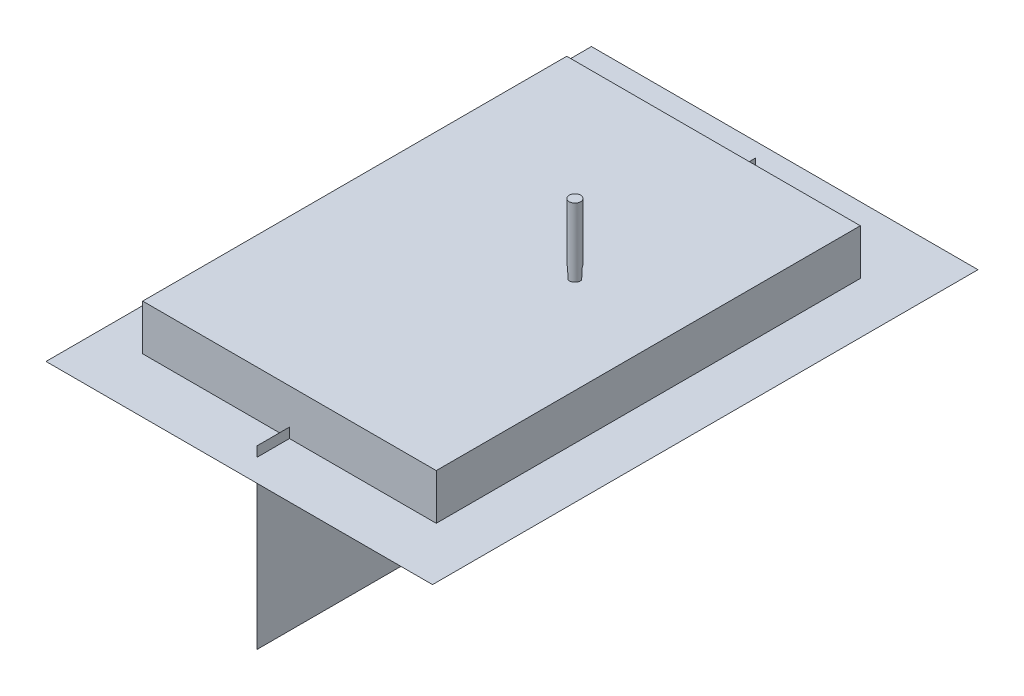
from build123d import *

# Parameters (mm, degrees)
BOSS_EXTRUDE1_DEPTH          = 2
BOSS_EXTRUDE2_DEPTH          = 2
BOSS_EXTRUDE3_DEPTH          = 2
BOSS_EXTRUDE4_DEPTH          = 2
SKETCH6_RX                   = 25
SKETCH6_RY                   = 7.5
BOSS_EXTRUDE5_DEPTH          = 2
BOSS_EXTRUDE6_DEPTH          = 2
BOSS_EXTRUDE7_DEPTH          = 2
BOSS_EXTRUDE8_DEPTH          = 2
BOSS_EXTRUDE9_DEPTH          = 2
SKETCH11_RX                  = 22.5
SKETCH11_RY                  = 12.5
BOSS_EXTRUDE10_DEPTH         = 2
BOSS_EXTRUDE11_DEPTH         = 2
BOSS_EXTRUDE12_DEPTH         = 1
BOSS_EXTRUDE13_START         = 2
SKETCH14_R                   = 3.5
BOSS_EXTRUDE13_DEPTH         = 50
CUT_EXTRUDE1_DEPTH           = 15
CUT_EXTRUDE1_DRAFT           = -5
CUT_EXTRUDE1_PROFILE_2_DEPTH = 15
CUT_EXTRUDE1_PROFILE_2_DRAFT = -5
SKETCH17_W                   = 180
SKETCH17_H                   = 260
BOSS_EXTRUDE14_DEPTH         = 28


with BuildPart() as part:
    # Sketch2 → Boss-Extrude1 (new body)
    with BuildSketch(Plane(origin=(0, 0, 0), x_dir=(1, 0, 0), z_dir=(0, 1, 0))):
        with BuildLine():
            ThreePointArc((84.993020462, 169.842764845), (0, 250), (-84.993020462, 169.842764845))
            ThreePointArc((-84.993020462, 169.842764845), (-83.737303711, 161.606035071), (-79.234438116, 154.595703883))
            ThreePointArc((-79.234438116, 154.595703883), (-53.016197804, 110.883102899), (-50, 60))
            ThreePointArc((-50, 60), (0, 0), (50, 60))
            ThreePointArc((50, 60), (53.016197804, 110.883102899), (79.234438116, 154.595703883))
            ThreePointArc((79.234438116, 154.595703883), (83.737303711, 161.606035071), (84.993020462, 169.842764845))
        make_face()
    extrude(amount=BOSS_EXTRUDE1_DEPTH)

    # Sketch3 → Boss-Extrude2 (add)
    with BuildSketch(Plane(origin=(0, 2, 0), x_dir=(1, 0, 0), z_dir=(0, 1, 0))):
        with BuildLine():
            ThreePointArc((77.81372295, 156.003385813), (81.866301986, 162.312683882), (82.996447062, 169.725740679))
            ThreePointArc((82.996447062, 169.725740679), (0, 248), (-82.996447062, 169.725740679))
            ThreePointArc((-82.996447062, 169.725740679), (-81.866301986, 162.312683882), (-77.81372295, 156.003385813))
            ThreePointArc((-77.81372295, 156.003385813), (-51.105368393, 111.473637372), (-48.032786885, 59.639344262))
            ThreePointArc((-48.032786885, 59.639344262), (0, 2), (48.032786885, 59.639344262))
            ThreePointArc((48.032786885, 59.639344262), (51.105368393, 111.473637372), (77.81372295, 156.003385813))
        make_face()
    extrude(amount=BOSS_EXTRUDE2_DEPTH)

    # Sketch4 → Boss-Extrude3 (add)
    with BuildSketch(Plane(origin=(0, 4, 0), x_dir=(1, 0, 0), z_dir=(0, 1, 0))):
        with BuildLine():
            ThreePointArc((76.393007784, 157.411067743), (49.194538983, 112.064171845), (46.06557377, 59.278688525))
            ThreePointArc((46.06557377, 59.278688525), (0, 4), (-46.06557377, 59.278688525))
            ThreePointArc((-46.06557377, 59.278688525), (-49.194538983, 112.064171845), (-76.393007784, 157.411067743))
            ThreePointArc((-76.393007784, 157.411067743), (-79.99530026, 163.019332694), (-80.999873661, 169.608716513))
            ThreePointArc((-80.999873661, 169.608716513), (0, 246), (80.999873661, 169.608716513))
            ThreePointArc((80.999873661, 169.608716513), (79.99530026, 163.019332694), (76.393007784, 157.411067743))
        make_face()
    extrude(amount=BOSS_EXTRUDE3_DEPTH)

    # Sketch5 → Boss-Extrude4 (add)
    with BuildSketch(Plane(origin=(0, 6, 0), x_dir=(1, 0, 0), z_dir=(0, 1, 0))):
        with BuildLine():
            ThreePointArc((74.972292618, 158.818749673), (78.124298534, 163.725981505), (79.00330026, 169.491692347))
            ThreePointArc((79.00330026, 169.491692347), (0, 244), (-79.00330026, 169.491692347))
            ThreePointArc((-79.00330026, 169.491692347), (-78.124298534, 163.725981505), (-74.972292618, 158.818749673))
            ThreePointArc((-74.972292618, 158.818749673), (-47.283709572, 112.654706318), (-44.098360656, 58.918032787))
            ThreePointArc((-44.098360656, 58.918032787), (0, 6), (44.098360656, 58.918032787))
            ThreePointArc((44.098360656, 58.918032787), (47.283709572, 112.654706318), (74.972292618, 158.818749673))
        make_face()
    extrude(amount=BOSS_EXTRUDE4_DEPTH)

    # Sketch6 → Boss-Extrude5 (add)
    with BuildSketch(Plane(origin=(0, 8, 0), x_dir=(1, 0, 0), z_dir=(0, 1, 0))):
        with BuildLine():
            ThreePointArc((73.551577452, 160.226431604), (45.372880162, 113.245240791), (42.131147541, 58.557377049))
            ThreePointArc((42.131147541, 58.557377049), (0, 8), (-42.131147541, 58.557377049))
            ThreePointArc((-42.131147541, 58.557377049), (-45.372880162, 113.245240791), (-73.551577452, 160.226431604))
            ThreePointArc((-73.551577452, 160.226431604), (-76.253296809, 164.432630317), (-77.006726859, 169.374668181))
            ThreePointArc((-77.006726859, 169.374668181), (0, 242), (77.006726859, 169.374668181))
            ThreePointArc((77.006726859, 169.374668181), (76.253296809, 164.432630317), (73.551577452, 160.226431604))
        make_face()
        with Locations(Location((0, 90), (0, 0, 90))):
            Ellipse(SKETCH6_RX, SKETCH6_RY, mode=Mode.SUBTRACT)
    extrude(amount=BOSS_EXTRUDE5_DEPTH)

    # Sketch7 → Boss-Extrude6 (add)
    with BuildSketch(Plane(origin=(0, 10, 0), x_dir=(1, 0, 0), z_dir=(0, 1, 0))):
        with BuildLine():
            ThreePointArc((72.130862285, 161.634113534), (74.382295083, 165.139279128), (75.010153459, 169.257644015))
            ThreePointArc((75.010153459, 169.257644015), (0, 240), (-75.010153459, 169.257644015))
            ThreePointArc((-75.010153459, 169.257644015), (-74.382295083, 165.139279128), (-72.130862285, 161.634113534))
            ThreePointArc((-72.130862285, 161.634113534), (-43.462050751, 113.835775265), (-40.163934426, 58.196721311))
            ThreePointArc((-40.163934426, 58.196721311), (0, 10), (40.163934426, 58.196721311))
            ThreePointArc((40.163934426, 58.196721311), (43.462050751, 113.835775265), (72.130862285, 161.634113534))
        make_face()
        with BuildLine():
            add(Edge.make_bspline(
                [(0, 63), (0.325638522, 63), (0.6446353, 63.037152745), (1.270377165, 63.179992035), (1.580018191, 63.287539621), (2.164968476, 63.55842676), (2.442332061, 63.721542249), (2.971325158, 64.094896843), (3.219533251, 64.302997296), (3.68254605, 64.745863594), (3.898862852, 64.981772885), (4.30742106, 65.47653604), (4.500372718, 65.736555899), (5.043524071, 66.535378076), (5.358753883, 67.091197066), (5.929882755, 68.232291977), (6.185263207, 68.817825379), (6.652882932, 70.010311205), (6.865011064, 70.617992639), (7.444553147, 72.443970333), (7.759677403, 73.673305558), (8.297315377, 76.14759818), (8.518868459, 77.392717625), (8.889342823, 79.895208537), (9.03798483, 81.152627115), (9.390124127, 84.94070343), (9.500938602, 87.494195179), (9.499049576, 92.56932897), (9.387606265, 95.098440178), (9.034576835, 98.877884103), (8.885502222, 100.135296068), (8.512678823, 102.644405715), (8.289260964, 103.89612872), (7.743966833, 106.392040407), (7.424517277, 107.627551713), (6.844140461, 109.443222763), (6.633516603, 110.042516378), (6.16684521, 111.225410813), (5.91104753, 111.809097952), (5.334148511, 112.95391138), (5.01354123, 113.513539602), (4.291269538, 114.565750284), (3.887450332, 115.063676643), (3.182281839, 115.729560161), (2.93436861, 115.933940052), (2.539084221, 116.208491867), (2.403407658, 116.294655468), (2.12330889, 116.455023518), (1.978283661, 116.529423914), (1.538241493, 116.728330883), (1.235886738, 116.830316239), (0.611611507, 116.967672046), (0.285022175, 117.002591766), (-0.357682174, 116.997097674), (-0.675532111, 116.958165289), (-1.147175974, 116.846752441), (-1.303760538, 116.800531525), (-1.608051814, 116.693090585), (-1.756709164, 116.631689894), (-2.192982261, 116.426133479), (-2.473188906, 116.258897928), (-2.997537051, 115.884129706), (-3.241938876, 115.677277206), (-3.933179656, 115.010749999), (-4.340316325, 114.501741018), (-5.056921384, 113.441876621), (-5.370996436, 112.886431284), (-5.941512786, 111.742293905), (-6.198373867, 111.150976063), (-6.663860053, 109.959342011), (-6.872999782, 109.358161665), (-7.447923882, 107.542692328), (-7.762101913, 106.316676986), (-8.298924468, 103.843847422), (-8.520705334, 102.596836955), (-8.89177981, 100.086344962), (-9.041026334, 98.820297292), (-9.392748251, 95.019570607), (-9.501041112, 92.490162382), (-9.498944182, 87.438987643), (-9.388463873, 84.917224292), (-9.036648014, 81.141082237), (-8.887942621, 79.883466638), (-8.515290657, 77.37086469), (-8.290900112, 76.112681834), (-7.74690502, 73.6201113), (-7.427805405, 72.383497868), (-6.845225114, 70.559791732), (-6.634114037, 69.959140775), (-6.167756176, 68.776755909), (-5.912717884, 68.194932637), (-5.483533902, 67.342182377), (-5.332625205, 67.061295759), (-5.011268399, 66.507897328), (-4.840694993, 66.235331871), (-4.479426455, 65.707710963), (-4.288325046, 65.451850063), (-3.879656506, 64.960228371), (-3.660580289, 64.723066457), (-2.964923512, 64.063311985), (-2.452570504, 63.690634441), (-1.280050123, 63.14961568), (-0.651277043, 63), (0, 63)],
                knots=[0, 0, 0, 0, 0.0078125, 0.0078125, 0.015625, 0.015625, 0.0234375, 0.0234375, 0.03125, 0.03125, 0.0390625, 0.0390625, 0.046875, 0.046875, 0.0625, 0.0625, 0.078125, 0.078125, 0.09375, 0.09375, 0.125, 0.125, 0.15625, 0.15625, 0.1875, 0.1875, 0.25, 0.25, 0.3125, 0.3125, 0.34375, 0.34375, 0.375, 0.375, 0.40625, 0.40625, 0.421875, 0.421875, 0.4375, 0.4375, 0.453125, 0.453125, 0.46875, 0.46875, 0.4765625, 0.4765625, 0.48046875, 0.48046875, 0.484375, 0.484375, 0.4921875, 0.4921875, 0.5, 0.5, 0.5078125, 0.5078125, 0.51171875, 0.51171875, 0.515625, 0.515625, 0.5234375, 0.5234375, 0.53125, 0.53125, 0.546875, 0.546875, 0.5625, 0.5625, 0.578125, 0.578125, 0.59375, 0.59375, 0.625, 0.625, 0.65625, 0.65625, 0.6875, 0.6875, 0.75, 0.75, 0.8125, 0.8125, 0.84375, 0.84375, 0.875, 0.875, 0.90625, 0.90625, 0.921875, 0.921875, 0.9375, 0.9375, 0.9453125, 0.9453125, 0.953125, 0.953125, 0.9609375, 0.9609375, 0.96875, 0.96875, 0.984375, 0.984375, 1, 1, 1, 1], degree=3))
        make_face(mode=Mode.SUBTRACT)
    extrude(amount=BOSS_EXTRUDE6_DEPTH)

    # Sketch8 → Boss-Extrude7 (add)
    with BuildSketch(Plane(origin=(0, 12, 0), x_dir=(1, 0, 0), z_dir=(0, 1, 0))):
        with BuildLine():
            ThreePointArc((70.710147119, 163.041795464), (41.551221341, 114.426309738), (38.196721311, 57.836065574))
            ThreePointArc((38.196721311, 57.836065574), (0, 12), (-38.196721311, 57.836065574))
            ThreePointArc((-38.196721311, 57.836065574), (-41.551221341, 114.426309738), (-70.710147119, 163.041795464))
            ThreePointArc((-70.710147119, 163.041795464), (-72.511293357, 165.845927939), (-73.013580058, 169.140619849))
            ThreePointArc((-73.013580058, 169.140619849), (0, 238), (73.013580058, 169.140619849))
            ThreePointArc((73.013580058, 169.140619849), (72.511293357, 165.845927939), (70.710147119, 163.041795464))
        make_face()
        with BuildLine():
            add(Edge.make_bspline(
                [(-0.053426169, 118.999771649), (-0.769278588, 118.993652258), (-1.462774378, 118.867022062), (-2.471710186, 118.508315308), (-2.796424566, 118.362256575), (-3.41787529, 118.02559468), (-3.715979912, 117.834729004), (-4.288798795, 117.411233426), (-4.560503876, 117.180663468), (-5.071483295, 116.694420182), (-5.312155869, 116.437700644), (-5.996705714, 115.633157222), (-6.405814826, 115.046738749), (-7.134462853, 113.837607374), (-7.455804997, 113.213062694), (-8.040094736, 111.936830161), (-8.302418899, 111.284852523), (-8.782648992, 109.960250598), (-9.000486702, 109.286139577), (-9.397082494, 107.936441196), (-9.576059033, 107.258932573), (-10.066228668, 105.219970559), (-10.332781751, 103.852372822), (-10.775825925, 101.104781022), (-10.952528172, 99.724816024), (-11.230822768, 96.95454774), (-11.332939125, 95.56431658), (-11.467885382, 92.774317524), (-11.500466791, 91.372417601), (-11.499051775, 87.167508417), (-11.366636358, 84.381726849), (-10.947436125, 80.232400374), (-10.770121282, 78.854291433), (-10.32575615, 76.110012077), (-10.058611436, 74.743854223), (-9.567185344, 72.706685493), (-9.387779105, 72.029704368), (-8.990149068, 70.680906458), (-8.771626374, 70.006878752), (-8.288007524, 68.678019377), (-8.023593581, 68.023375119), (-7.580646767, 67.061463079), (-7.425256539, 66.744176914), (-7.096121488, 66.117550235), (-6.921970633, 65.80781278), (-6.372427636, 64.903397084), (-5.968940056, 64.330072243), (-5.285135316, 63.532771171), (-5.044049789, 63.277495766), (-4.529911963, 62.79244819), (-4.25488621, 62.56099042), (-3.681671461, 62.141625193), (-3.382795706, 61.952619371), (-2.75831387, 61.619658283), (-2.429988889, 61.47450515), (-1.420837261, 61.123351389), (-0.72674885, 61.00110487), (0.707611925, 60.998909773), (1.404158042, 61.119188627), (2.757883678, 61.587269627), (3.382194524, 61.924468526), (4.537943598, 62.767428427), (5.048123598, 63.257007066), (5.968264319, 64.328656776), (6.380660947, 64.915544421), (7.113272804, 66.12333634), (7.436569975, 66.748182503), (8.024744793, 68.026331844), (8.288789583, 68.680040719), (8.772345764, 70.009151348), (8.990832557, 70.683135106), (9.388617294, 72.032603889), (9.568205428, 72.710320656), (10.060114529, 74.75070979), (10.327817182, 76.12027539), (10.772849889, 78.873368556), (10.950460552, 80.256852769), (11.230060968, 83.035504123), (11.332470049, 84.430606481), (11.467871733, 87.23153558), (11.50064207, 88.639074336), (11.498687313, 92.844216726), (11.365940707, 95.634700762), (10.943826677, 99.798466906), (10.765101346, 101.182644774), (10.316391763, 103.942013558), (10.046138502, 105.317177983), (9.547269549, 107.370718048), (9.364728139, 108.053809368), (8.963177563, 109.404488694), (8.744324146, 110.073514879), (8.259237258, 111.395020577), (7.993532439, 112.047684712), (7.39726865, 113.330363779), (7.069931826, 113.954675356), (6.335566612, 115.150950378), (5.929277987, 115.724154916), (5.230578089, 116.527047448), (4.984045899, 116.783047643), (4.466856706, 117.262029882), (4.195159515, 117.485811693), (3.621525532, 117.897119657), (3.316758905, 118.086013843), (2.689699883, 118.412284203), (2.36735233, 118.550473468), (1.704132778, 118.77444703), (1.363301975, 118.860347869), (0.661331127, 118.974695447), (0.304500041, 119.002831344), (-0.053426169, 118.999771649)],
                knots=[0, 0, 0, 0, 0.015625, 0.015625, 0.0234375, 0.0234375, 0.03125, 0.03125, 0.0390625, 0.0390625, 0.046875, 0.046875, 0.0625, 0.0625, 0.078125, 0.078125, 0.09375, 0.09375, 0.109375, 0.109375, 0.125, 0.125, 0.15625, 0.15625, 0.1875, 0.1875, 0.21875, 0.21875, 0.25, 0.25, 0.3125, 0.3125, 0.34375, 0.34375, 0.375, 0.375, 0.390625, 0.390625, 0.40625, 0.40625, 0.421875, 0.421875, 0.4296875, 0.4296875, 0.4375, 0.4375, 0.453125, 0.453125, 0.4609375, 0.4609375, 0.46875, 0.46875, 0.4765625, 0.4765625, 0.484375, 0.484375, 0.5, 0.5, 0.515625, 0.515625, 0.53125, 0.53125, 0.546875, 0.546875, 0.5625, 0.5625, 0.578125, 0.578125, 0.59375, 0.59375, 0.609375, 0.609375, 0.625, 0.625, 0.65625, 0.65625, 0.6875, 0.6875, 0.71875, 0.71875, 0.75, 0.75, 0.8125, 0.8125, 0.84375, 0.84375, 0.875, 0.875, 0.890625, 0.890625, 0.90625, 0.90625, 0.921875, 0.921875, 0.9375, 0.9375, 0.953125, 0.953125, 0.9609375, 0.9609375, 0.96875, 0.96875, 0.9765625, 0.9765625, 0.984375, 0.984375, 0.9921875, 0.9921875, 1, 1, 1, 1], degree=3))
        make_face(mode=Mode.SUBTRACT)
    extrude(amount=BOSS_EXTRUDE7_DEPTH)

    # Sketch9 → Boss-Extrude8 (add)
    with BuildSketch(Plane(origin=(0, 14, 0), x_dir=(1, 0, 0), z_dir=(0, 1, 0))):
        with BuildLine():
            ThreePointArc((69.289431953, 164.449477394), (70.640291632, 166.552576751), (71.017006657, 169.023595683))
            ThreePointArc((71.017006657, 169.023595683), (0, 236), (-71.017006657, 169.023595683))
            ThreePointArc((-71.017006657, 169.023595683), (-70.640291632, 166.552576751), (-69.289431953, 164.449477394))
            ThreePointArc((-69.289431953, 164.449477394), (-39.64039193, 115.016844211), (-36.229508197, 57.475409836))
            ThreePointArc((-36.229508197, 57.475409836), (0, 14), (36.229508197, 57.475409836))
            ThreePointArc((36.229508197, 57.475409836), (39.64039193, 115.016844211), (69.289431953, 164.449477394))
        make_face()
        with BuildLine():
            add(Edge.make_bspline(
                [(-0.012629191, 59.000009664), (0.770008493, 58.998811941), (1.534188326, 59.107037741), (2.653979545, 59.426348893), (3.023779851, 59.559644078), (3.734034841, 59.869906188), (4.07715051, 60.047559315), (4.740838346, 60.445134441), (5.06286345, 60.666210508), (5.6787524, 61.142954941), (5.970423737, 61.396763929), (6.802485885, 62.198935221), (7.300382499, 62.78760771), (7.98123071, 63.733221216), (8.196090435, 64.057596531), (8.600886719, 64.7153477), (8.791623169, 65.04976691), (9.33399082, 66.067210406), (9.656533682, 66.764062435), (10.243929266, 68.185190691), (10.508637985, 68.909870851), (10.992515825, 70.379516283), (11.209671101, 71.117808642), (11.801849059, 73.340985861), (12.119399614, 74.833916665), (12.645903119, 77.834981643), (12.854678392, 79.343140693), (13.182816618, 82.371976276), (13.302603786, 83.89259342), (13.461396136, 86.945136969), (13.500236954, 88.479559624), (13.499522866, 93.082258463), (13.345579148, 96.130488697), (12.853171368, 100.668354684), (12.644348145, 102.175084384), (12.117794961, 105.174183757), (11.799997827, 106.666544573), (11.207429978, 108.889807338), (10.990163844, 109.628291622), (10.505706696, 111.098677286), (10.240078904, 111.825126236), (9.650270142, 113.250226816), (9.325879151, 113.949602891), (8.597192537, 115.312654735), (8.190740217, 115.978537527), (7.288651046, 117.227680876), (6.790990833, 117.814036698), (5.953040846, 118.618591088), (5.656969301, 118.875025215), (5.043781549, 119.347350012), (4.725419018, 119.564630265), (4.063849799, 119.959329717), (3.720567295, 120.136627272), (3.006587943, 120.447237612), (2.639237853, 120.578695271), (1.898283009, 120.788454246), (1.522502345, 120.867530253), (0.760240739, 120.97361895), (0.37190259, 121.00080565), (-0.797884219, 120.998324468), (-1.560484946, 120.888126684), (-2.679344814, 120.565326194), (-3.048046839, 120.431049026), (-3.756171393, 120.119004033), (-4.098430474, 119.940505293), (-4.760895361, 119.541512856), (-5.082834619, 119.319511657), (-5.696171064, 118.84224194), (-5.986760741, 118.58816535), (-6.816328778, 117.785406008), (-7.313269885, 117.196350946), (-8.219473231, 115.934034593), (-8.619995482, 115.273498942), (-9.341215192, 113.917813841), (-9.662980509, 113.221243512), (-10.249347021, 111.800542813), (-10.514015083, 111.074958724), (-10.996399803, 109.607639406), (-11.212980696, 108.870414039), (-11.803771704, 106.650197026), (-12.120797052, 105.158920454), (-12.646519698, 102.16067275), (-12.855039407, 100.653675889), (-13.182906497, 97.626762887), (-13.302819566, 96.106928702), (-13.461672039, 93.055528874), (-13.5002027, 91.520643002), (-13.499592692, 86.924760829), (-13.346206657, 83.879437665), (-12.854657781, 79.343240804), (-12.646103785, 77.836610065), (-12.119883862, 74.836613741), (-11.802347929, 73.343232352), (-11.209525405, 71.117325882), (-10.991306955, 70.375664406), (-10.508714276, 68.910098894), (-10.244601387, 68.186878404), (-9.657098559, 66.765280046), (-9.333741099, 66.066888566), (-8.788377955, 65.044583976), (-8.595885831, 64.707372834), (-8.19113625, 64.050027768), (-7.978620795, 63.729212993), (-7.305534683, 62.79430757), (-6.810168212, 62.207179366), (-5.973082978, 61.399352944), (-5.679476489, 61.143711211), (-5.070797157, 60.671264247), (-4.754183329, 60.453432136), (-4.094670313, 60.057153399), (-3.751204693, 59.878444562), (-3.037961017, 59.565033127), (-2.674847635, 59.433390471), (-1.935635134, 59.220241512), (-1.559514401, 59.138818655), (-0.793573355, 59.028865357), (-0.403948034, 59.000608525), (-0.012629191, 59.000009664)],
                knots=[0, 0, 0, 0, 0.015625, 0.015625, 0.0234375, 0.0234375, 0.03125, 0.03125, 0.0390625, 0.0390625, 0.046875, 0.046875, 0.0625, 0.0625, 0.0703125, 0.0703125, 0.078125, 0.078125, 0.09375, 0.09375, 0.109375, 0.109375, 0.125, 0.125, 0.15625, 0.15625, 0.1875, 0.1875, 0.21875, 0.21875, 0.25, 0.25, 0.3125, 0.3125, 0.34375, 0.34375, 0.375, 0.375, 0.390625, 0.390625, 0.40625, 0.40625, 0.421875, 0.421875, 0.4375, 0.4375, 0.453125, 0.453125, 0.4609375, 0.4609375, 0.46875, 0.46875, 0.4765625, 0.4765625, 0.484375, 0.484375, 0.4921875, 0.4921875, 0.5, 0.5, 0.515625, 0.515625, 0.5234375, 0.5234375, 0.53125, 0.53125, 0.5390625, 0.5390625, 0.546875, 0.546875, 0.5625, 0.5625, 0.578125, 0.578125, 0.59375, 0.59375, 0.609375, 0.609375, 0.625, 0.625, 0.65625, 0.65625, 0.6875, 0.6875, 0.71875, 0.71875, 0.75, 0.75, 0.8125, 0.8125, 0.84375, 0.84375, 0.875, 0.875, 0.890625, 0.890625, 0.90625, 0.90625, 0.921875, 0.921875, 0.9296875, 0.9296875, 0.9375, 0.9375, 0.953125, 0.953125, 0.9609375, 0.9609375, 0.96875, 0.96875, 0.9765625, 0.9765625, 0.984375, 0.984375, 0.9921875, 0.9921875, 1, 1, 1, 1], degree=3))
        make_face(mode=Mode.SUBTRACT)
    extrude(amount=BOSS_EXTRUDE8_DEPTH)

    # Sketch10 → Boss-Extrude9 (add)
    with BuildSketch(Plane(origin=(0, 16, 0), x_dir=(1, 0, 0), z_dir=(0, 1, 0))):
        with BuildLine():
            ThreePointArc((66.448001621, 167.264841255), (35.818733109, 116.197913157), (32.295081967, 56.754098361))
            ThreePointArc((32.295081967, 56.754098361), (0, 18), (-32.295081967, 56.754098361))
            ThreePointArc((-32.295081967, 56.754098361), (-35.818733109, 116.197913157), (-66.448001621, 167.264841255))
            ThreePointArc((-66.448001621, 167.264841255), (-66.89828818, 167.965874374), (-67.023859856, 168.789547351))
            ThreePointArc((-67.023859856, 168.789547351), (0, 232), (67.023859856, 168.789547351))
            ThreePointArc((67.023859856, 168.789547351), (66.89828818, 167.965874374), (66.448001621, 167.264841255))
        make_face()
        with BuildLine():
            add(Edge.make_bspline(
                [(-0.022268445, 122.99997409), (-0.868771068, 122.998178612), (-1.699084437, 122.893383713), (-2.920912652, 122.585777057), (-3.326114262, 122.457196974), (-4.110540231, 122.156736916), (-4.4915795, 121.984392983), (-5.232407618, 121.597648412), (-5.592218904, 121.383292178), (-6.291252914, 120.913832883), (-6.629619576, 120.659006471), (-7.595203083, 119.852512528), (-8.180745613, 119.254442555), (-8.986044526, 118.281527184), (-9.241412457, 117.945328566), (-9.723386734, 117.260826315), (-9.951015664, 116.911247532), (-10.598824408, 115.843269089), (-10.984367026, 115.105869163), (-11.685341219, 113.592609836), (-12.001850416, 112.813747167), (-12.574071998, 111.241356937), (-12.829635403, 110.449463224), (-13.525900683, 108.060644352), (-13.897070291, 106.450747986), (-14.5102023, 103.206851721), (-14.752734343, 101.572958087), (-15.133390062, 98.285693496), (-15.27227255, 96.632464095), (-15.456176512, 93.30849557), (-15.500111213, 91.649802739), (-15.499777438, 86.683900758), (-15.325565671, 83.38618073), (-14.757554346, 78.462306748), (-14.515569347, 76.824913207), (-13.899640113, 73.559895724), (-13.522621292, 71.926355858), (-12.593257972, 68.741483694), (-12.042569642, 67.183116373), (-11.002154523, 64.930486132), (-10.618960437, 64.194023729), (-9.969885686, 63.118755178), (-9.740123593, 62.763930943), (-9.255369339, 62.072902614), (-9.001331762, 61.737710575), (-8.200214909, 60.766661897), (-7.6134841, 60.164554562), (-6.315241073, 59.076285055), (-5.622344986, 58.607207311), (-4.511984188, 58.025357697), (-4.130079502, 57.851613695), (-3.340885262, 57.547651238), (-2.936512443, 57.418945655), (-1.718450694, 57.11020673), (-0.890362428, 57.003856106), (0.376595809, 56.998224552), (0.801540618, 57.022485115), (1.635303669, 57.12197626), (2.047109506, 57.197129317), (2.860829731, 57.396949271), (3.262749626, 57.521588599), (4.056725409, 57.82024373), (4.442061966, 57.992034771), (5.187886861, 58.37670774), (5.548885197, 58.58977034), (6.248289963, 59.055197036), (6.58824035, 59.308697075), (7.564553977, 60.11732774), (8.150887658, 60.713688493), (8.953190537, 61.676733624), (9.20767989, 62.00923581), (9.693574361, 62.694724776), (9.925626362, 63.04896086), (10.582479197, 64.126397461), (10.970390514, 64.866374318), (12.024233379, 67.133975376), (12.583010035, 68.708356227), (13.524983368, 71.932188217), (13.89837733, 73.554296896), (14.513470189, 76.812268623), (14.755598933, 78.448086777), (15.324537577, 83.371985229), (15.499939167, 86.675878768), (15.500030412, 91.659188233), (15.45579078, 93.328731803), (15.271080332, 96.654133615), (15.131204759, 98.310312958), (14.74798491, 101.608471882), (14.503530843, 103.250299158), (14.038282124, 105.699512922), (13.866308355, 106.513599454), (13.48199156, 108.136232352), (13.269574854, 108.94639083), (12.563064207, 111.350070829), (12.003647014, 112.92052007), (10.939441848, 115.194716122), (10.548140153, 115.933892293), (9.682155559, 117.346136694), (9.206536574, 118.021732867), (8.409661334, 118.975368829), (8.130069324, 119.283245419), (7.539335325, 119.876404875), (7.226501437, 120.162863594), (6.256469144, 120.965127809), (5.56314154, 121.429124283), (4.445043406, 122.006473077), (4.056790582, 122.179650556), (3.271769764, 122.4755052), (2.873542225, 122.599414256), (2.065522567, 122.798648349), (1.655737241, 122.874001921), (0.824364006, 122.975125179), (0.400982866, 123.000871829), (-0.022268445, 122.99997409)],
                knots=[0, 0, 0, 0, 0.015625, 0.015625, 0.0234375, 0.0234375, 0.03125, 0.03125, 0.0390625, 0.0390625, 0.046875, 0.046875, 0.0625, 0.0625, 0.0703125, 0.0703125, 0.078125, 0.078125, 0.09375, 0.09375, 0.109375, 0.109375, 0.125, 0.125, 0.15625, 0.15625, 0.1875, 0.1875, 0.21875, 0.21875, 0.25, 0.25, 0.3125, 0.3125, 0.34375, 0.34375, 0.375, 0.375, 0.40625, 0.40625, 0.421875, 0.421875, 0.4296875, 0.4296875, 0.4375, 0.4375, 0.453125, 0.453125, 0.46875, 0.46875, 0.4765625, 0.4765625, 0.484375, 0.484375, 0.5, 0.5, 0.5078125, 0.5078125, 0.515625, 0.515625, 0.5234375, 0.5234375, 0.53125, 0.53125, 0.5390625, 0.5390625, 0.546875, 0.546875, 0.5625, 0.5625, 0.5703125, 0.5703125, 0.578125, 0.578125, 0.59375, 0.59375, 0.625, 0.625, 0.65625, 0.65625, 0.6875, 0.6875, 0.75, 0.75, 0.78125, 0.78125, 0.8125, 0.8125, 0.84375, 0.84375, 0.859375, 0.859375, 0.875, 0.875, 0.90625, 0.90625, 0.921875, 0.921875, 0.9375, 0.9375, 0.9453125, 0.9453125, 0.953125, 0.953125, 0.96875, 0.96875, 0.9765625, 0.9765625, 0.984375, 0.984375, 0.9921875, 0.9921875, 1, 1, 1, 1], degree=3))
        make_face(mode=Mode.SUBTRACT)
    extrude(amount=BOSS_EXTRUDE9_DEPTH)

    # Sketch11 → Boss-Extrude10 (add)
    with BuildSketch(Plane(origin=(0, 18, 0), x_dir=(1, 0, 0), z_dir=(0, 1, 0))):
        with Locations(Location((0, 42), (0, 0, 180))):
            Ellipse(SKETCH11_RX, SKETCH11_RY)
        with BuildLine():
            ThreePointArc((-50, 185), (0, 215), (50, 185))
            ThreePointArc((50, 185), (47.162091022, 167.995734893), (30, 166.364357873))
            ThreePointArc((30, 166.364357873), (0, 175), (-30, 166.364357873))
            ThreePointArc((-30, 166.364357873), (-47.162091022, 167.995734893), (-50, 185))
        make_face()
    extrude(amount=BOSS_EXTRUDE10_DEPTH)

    # Sketch12 → Boss-Extrude11 (add)
    with BuildSketch(Plane(origin=(0, 20, 0), x_dir=(1, 0, 0), z_dir=(0, 1, 0))):
        with BuildLine():
            ThreePointArc((-46.470588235, 183.117647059), (-44.435245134, 170.922219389), (-32.126625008, 169.75219879))
            ThreePointArc((-32.126625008, 169.75219879), (0, 179), (32.126625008, 169.75219879))
            ThreePointArc((32.126625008, 169.75219879), (44.435245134, 170.922219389), (46.470588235, 183.117647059))
            ThreePointArc((46.470588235, 183.117647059), (0, 211), (-46.470588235, 183.117647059))
        make_face()
    extrude(amount=BOSS_EXTRUDE11_DEPTH)

    # Sketch13 → Boss-Extrude12 (add)
    with BuildSketch(Plane(origin=(0, 22, 0), x_dir=(1, 0, 0), z_dir=(0, 1, 0))):
        with BuildLine():
            ThreePointArc((42.941176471, 181.235294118), (0, 207), (-42.941176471, 181.235294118))
            ThreePointArc((-42.941176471, 181.235294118), (-41.708399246, 173.848703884), (-34.253250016, 173.140039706))
            ThreePointArc((-34.253250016, 173.140039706), (0, 183), (34.253250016, 173.140039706))
            ThreePointArc((34.253250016, 173.140039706), (41.708399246, 173.848703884), (42.941176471, 181.235294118))
        make_face()
    extrude(amount=BOSS_EXTRUDE12_DEPTH)


with BuildPart() as body_2:
    # Sketch14 → Boss-Extrude13 (new body)
    with BuildSketch(Plane(origin=(0, 18, 0), x_dir=(1, 0, 0), z_dir=(0, 1, 0)).offset(BOSS_EXTRUDE13_START)):
        with Locations(Location((30, 140, 0), (0, 0, 270))):
            Circle(SKETCH14_R)
    extrude(amount=BOSS_EXTRUDE13_DEPTH)


with BuildPart() as cut_extrude1_tool:
    # Sketch15 → Cut-Extrude1 (with draft: the straight prism first)
    with BuildSketch(Plane.XZ.offset(-20)):
        Polygon((26.5, -140), (30, -140), (30, -136.5), (30, -132.655492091), (23.225915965, -140), align=None)
    extrude(amount=-CUT_EXTRUDE1_DEPTH)
    # Cut-Extrude1: the draft: its side faces are tilted about the plane it starts from
    cut_extrude1_sides = [cut_extrude1_tool.faces().sort_by_distance(p)[0] for p in [
        (26.612957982, 27.5, -140),
        (26.612957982, 27.5, -136.327746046),
        (30, 27.5, -136.327746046),
    ]]
    draft(cut_extrude1_sides, Plane.XZ.offset(-20), CUT_EXTRUDE1_DRAFT)


with BuildPart() as body_2_1:
    add(body_2.part)

    # Cut-Extrude1: cut by cut_extrude1_tool
    add(cut_extrude1_tool.part, mode=Mode.SUBTRACT)


with BuildPart() as cut_extrude1_profile_2_tool:
    # Sketch15 → Cut-Extrude1 profile 2 (with draft: the straight prism first)
    with BuildSketch(Plane.XZ.offset(-20)):
        Polygon((37.671515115, -140), (30, -140), (30, -148.31750878), align=None)
    extrude(amount=-CUT_EXTRUDE1_PROFILE_2_DEPTH)
    # Cut-Extrude1 profile 2: the draft: its side faces are tilted about the plane it starts from
    cut_extrude1_profile_2_sides = [cut_extrude1_profile_2_tool.faces().sort_by_distance(p)[0] for p in [
        (33.835757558, 27.5, -140),
        (30, 27.5, -144.15875439),
        (33.835757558, 27.5, -144.15875439),
    ]]
    draft(cut_extrude1_profile_2_sides, Plane.XZ.offset(-20), CUT_EXTRUDE1_PROFILE_2_DRAFT)


with BuildPart() as body_2_2:
    add(body_2_1.part)

    # Cut-Extrude1 profile 2: cut by cut_extrude1_profile_2_tool
    add(cut_extrude1_profile_2_tool.part, mode=Mode.SUBTRACT)


with BuildPart() as body_3:
    # Sketch17 → Boss-Extrude14 (new body)
    with BuildSketch(Plane(origin=(0, 0, 0), x_dir=(1, 0, 0), z_dir=(0, 1, 0))):
        with Locations((0, 125)):
            Rectangle(SKETCH17_W, SKETCH17_H)
    extrude(amount=BOSS_EXTRUDE14_DEPTH)

    # Combine1: cut part
    add(part.part, mode=Mode.SUBTRACT)


solid = Compound([body_2_2.part, body_3.part])
